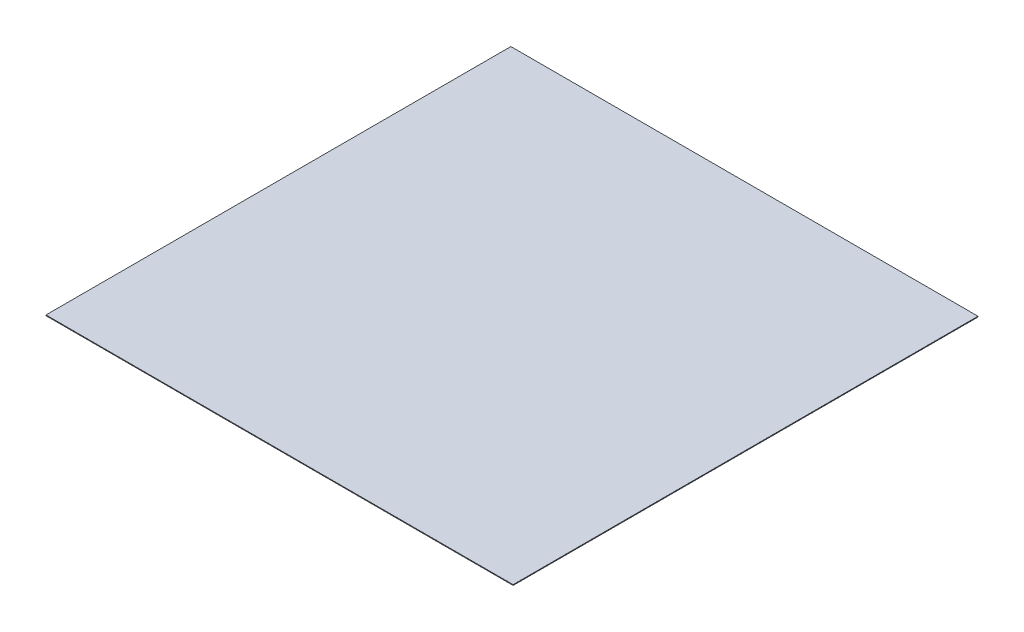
ISO-10303-21;
HEADER;
FILE_DESCRIPTION(('STEP AP214'),'2;1');
FILE_NAME('part.step','',(''),(''),'','','');
FILE_SCHEMA(('AUTOMOTIVE_DESIGN { 1 0 10303 214 1 1 1 1 }'));
ENDSEC;
DATA;
#1=APPLICATION_CONTEXT('core data for automotive mechanical design processes');
#2=APPLICATION_PROTOCOL_DEFINITION('international standard','automotive_design',2000,#1);
#3=PRODUCT_CONTEXT('',#1,'mechanical');
#4=PRODUCT('Part','Part','',(#3));
#5=PRODUCT_RELATED_PRODUCT_CATEGORY('part','',(#4));
#6=PRODUCT_DEFINITION_FORMATION('','',#4);
#7=PRODUCT_DEFINITION_CONTEXT('part definition',#1,'design');
#8=PRODUCT_DEFINITION('design','',#6,#7);
#9=PRODUCT_DEFINITION_SHAPE('','',#8);
#10=(LENGTH_UNIT() NAMED_UNIT(*) SI_UNIT(.MILLI.,.METRE.));
#11=(NAMED_UNIT(*) PLANE_ANGLE_UNIT() SI_UNIT($,.RADIAN.));
#12=(NAMED_UNIT(*) SI_UNIT($,.STERADIAN.) SOLID_ANGLE_UNIT());
#13=UNCERTAINTY_MEASURE_WITH_UNIT(LENGTH_MEASURE(1.E-05),#10,'distance_accuracy_value','');
#14=(GEOMETRIC_REPRESENTATION_CONTEXT(3) GLOBAL_UNCERTAINTY_ASSIGNED_CONTEXT((#13)) GLOBAL_UNIT_ASSIGNED_CONTEXT((#10,
#11,#12)) REPRESENTATION_CONTEXT('',''));
#15=CARTESIAN_POINT('',(0.,0.,0.));
#16=DIRECTION('',(0.,0.,1.));
#17=DIRECTION('',(1.,0.,0.));
#18=AXIS2_PLACEMENT_3D('',#15,#16,#17);
#19=CARTESIAN_POINT('',(0.,0.,0.));
#20=DIRECTION('',(0.,-1.,0.));
#21=DIRECTION('',(0.,0.,-1.));
#22=AXIS2_PLACEMENT_3D('',#19,#20,#21);
#23=PLANE('',#22);
#24=DIRECTION('',(1.,0.,0.));
#25=VECTOR('',#24,1.);
#26=CARTESIAN_POINT('',(0.,0.,0.));
#27=LINE('',#26,#25);
#28=CARTESIAN_POINT('',(518.5,0.,0.));
#29=VERTEX_POINT('',#28);
#30=CARTESIAN_POINT('',(0.,0.,0.));
#31=VERTEX_POINT('',#30);
#32=EDGE_CURVE('E79',#29,#31,#27,.F.);
#33=ORIENTED_EDGE('',*,*,#32,.F.);
#34=DIRECTION('',(0.,0.,-1.));
#35=VECTOR('',#34,1.);
#36=CARTESIAN_POINT('',(518.5,0.,0.));
#37=LINE('',#36,#35);
#38=CARTESIAN_POINT('',(518.5,0.,-516.));
#39=VERTEX_POINT('',#38);
#40=EDGE_CURVE('E55',#39,#29,#37,.F.);
#41=ORIENTED_EDGE('',*,*,#40,.F.);
#42=DIRECTION('',(-1.,0.,0.));
#43=VECTOR('',#42,1.);
#44=CARTESIAN_POINT('',(0.,0.,-516.));
#45=LINE('',#44,#43);
#46=CARTESIAN_POINT('',(0.,0.,-516.));
#47=VERTEX_POINT('',#46);
#48=EDGE_CURVE('E57',#47,#39,#45,.F.);
#49=ORIENTED_EDGE('',*,*,#48,.F.);
#50=DIRECTION('',(0.,0.,1.));
#51=VECTOR('',#50,1.);
#52=CARTESIAN_POINT('',(0.,0.,0.));
#53=LINE('',#52,#51);
#54=EDGE_CURVE('E20',#31,#47,#53,.F.);
#55=ORIENTED_EDGE('',*,*,#54,.F.);
#56=EDGE_LOOP('',(#33,#41,#49,#55));
#57=FACE_BOUND('',#56,.T.);
#58=ADVANCED_FACE('F17',(#57),#23,.F.);
#59=CARTESIAN_POINT('',(0.,-0.8,0.));
#60=DIRECTION('',(-1.,0.,0.));
#61=DIRECTION('',(0.,0.,1.));
#62=AXIS2_PLACEMENT_3D('',#59,#60,#61);
#63=PLANE('',#62);
#64=DIRECTION('',(0.,0.,-1.));
#65=VECTOR('',#64,1.);
#66=CARTESIAN_POINT('',(0.,-0.8,0.));
#67=LINE('',#66,#65);
#68=CARTESIAN_POINT('',(0.,-0.8,0.));
#69=VERTEX_POINT('',#68);
#70=CARTESIAN_POINT('',(0.,-0.8,-516.));
#71=VERTEX_POINT('',#70);
#72=EDGE_CURVE('E83',#69,#71,#67,.T.);
#73=ORIENTED_EDGE('',*,*,#72,.F.);
#74=DIRECTION('',(0.,1.,0.));
#75=VECTOR('',#74,1.);
#76=CARTESIAN_POINT('',(0.,-0.8,0.));
#77=LINE('',#76,#75);
#78=EDGE_CURVE('E68',#31,#69,#77,.F.);
#79=ORIENTED_EDGE('',*,*,#78,.F.);
#80=ORIENTED_EDGE('',*,*,#54,.T.);
#81=DIRECTION('',(0.,1.,0.));
#82=VECTOR('',#81,1.);
#83=CARTESIAN_POINT('',(0.,-0.8,-516.));
#84=LINE('',#83,#82);
#85=EDGE_CURVE('E63',#71,#47,#84,.T.);
#86=ORIENTED_EDGE('',*,*,#85,.F.);
#87=EDGE_LOOP('',(#73,#79,#80,#86));
#88=FACE_BOUND('',#87,.T.);
#89=ADVANCED_FACE('F65',(#88),#63,.T.);
#90=CARTESIAN_POINT('',(0.,-0.8,-516.));
#91=DIRECTION('',(0.,0.,-1.));
#92=DIRECTION('',(-1.,0.,0.));
#93=AXIS2_PLACEMENT_3D('',#90,#91,#92);
#94=PLANE('',#93);
#95=DIRECTION('',(1.,0.,0.));
#96=VECTOR('',#95,1.);
#97=CARTESIAN_POINT('',(0.,-0.8,-516.));
#98=LINE('',#97,#96);
#99=CARTESIAN_POINT('',(518.5,-0.8,-516.));
#100=VERTEX_POINT('',#99);
#101=EDGE_CURVE('E72',#71,#100,#98,.T.);
#102=ORIENTED_EDGE('',*,*,#101,.F.);
#103=ORIENTED_EDGE('',*,*,#85,.T.);
#104=ORIENTED_EDGE('',*,*,#48,.T.);
#105=DIRECTION('',(0.,1.,0.));
#106=VECTOR('',#105,1.);
#107=CARTESIAN_POINT('',(518.5,-0.8,-516.));
#108=LINE('',#107,#106);
#109=EDGE_CURVE('E75',#100,#39,#108,.T.);
#110=ORIENTED_EDGE('',*,*,#109,.F.);
#111=EDGE_LOOP('',(#102,#103,#104,#110));
#112=FACE_BOUND('',#111,.T.);
#113=ADVANCED_FACE('F70',(#112),#94,.T.);
#114=CARTESIAN_POINT('',(518.5,-0.8,0.));
#115=DIRECTION('',(1.,0.,0.));
#116=DIRECTION('',(0.,0.,-1.));
#117=AXIS2_PLACEMENT_3D('',#114,#115,#116);
#118=PLANE('',#117);
#119=DIRECTION('',(0.,0.,-1.));
#120=VECTOR('',#119,1.);
#121=CARTESIAN_POINT('',(518.5,-0.8,0.));
#122=LINE('',#121,#120);
#123=CARTESIAN_POINT('',(518.5,-0.8,0.));
#124=VERTEX_POINT('',#123);
#125=EDGE_CURVE('E26',#100,#124,#122,.F.);
#126=ORIENTED_EDGE('',*,*,#125,.F.);
#127=ORIENTED_EDGE('',*,*,#109,.T.);
#128=ORIENTED_EDGE('',*,*,#40,.T.);
#129=DIRECTION('',(0.,1.,0.));
#130=VECTOR('',#129,1.);
#131=CARTESIAN_POINT('',(518.5,-0.8,0.));
#132=LINE('',#131,#130);
#133=EDGE_CURVE('E35',#124,#29,#132,.T.);
#134=ORIENTED_EDGE('',*,*,#133,.F.);
#135=EDGE_LOOP('',(#126,#127,#128,#134));
#136=FACE_BOUND('',#135,.T.);
#137=ADVANCED_FACE('F89',(#136),#118,.T.);
#138=CARTESIAN_POINT('',(0.,-0.8,0.));
#139=DIRECTION('',(0.,0.,1.));
#140=DIRECTION('',(1.,0.,0.));
#141=AXIS2_PLACEMENT_3D('',#138,#139,#140);
#142=PLANE('',#141);
#143=DIRECTION('',(1.,0.,0.));
#144=VECTOR('',#143,1.);
#145=CARTESIAN_POINT('',(0.,-0.8,0.));
#146=LINE('',#145,#144);
#147=EDGE_CURVE('E11',#124,#69,#146,.F.);
#148=ORIENTED_EDGE('',*,*,#147,.F.);
#149=ORIENTED_EDGE('',*,*,#133,.T.);
#150=ORIENTED_EDGE('',*,*,#32,.T.);
#151=ORIENTED_EDGE('',*,*,#78,.T.);
#152=EDGE_LOOP('',(#148,#149,#150,#151));
#153=FACE_BOUND('',#152,.T.);
#154=ADVANCED_FACE('F91',(#153),#142,.T.);
#155=CARTESIAN_POINT('',(0.,-0.8,0.));
#156=DIRECTION('',(0.,-1.,0.));
#157=DIRECTION('',(0.,0.,-1.));
#158=AXIS2_PLACEMENT_3D('',#155,#156,#157);
#159=PLANE('',#158);
#160=ORIENTED_EDGE('',*,*,#125,.T.);
#161=ORIENTED_EDGE('',*,*,#147,.T.);
#162=ORIENTED_EDGE('',*,*,#72,.T.);
#163=ORIENTED_EDGE('',*,*,#101,.T.);
#164=EDGE_LOOP('',(#160,#161,#162,#163));
#165=FACE_BOUND('',#164,.T.);
#166=ADVANCED_FACE('F88',(#165),#159,.T.);
#167=CLOSED_SHELL('',(#58,#89,#113,#137,#154,#166));
#168=MANIFOLD_SOLID_BREP('B1',#167);
#169=ADVANCED_BREP_SHAPE_REPRESENTATION('',(#18,#168),#14);
#170=SHAPE_DEFINITION_REPRESENTATION(#9,#169);
ENDSEC;
END-ISO-10303-21;
